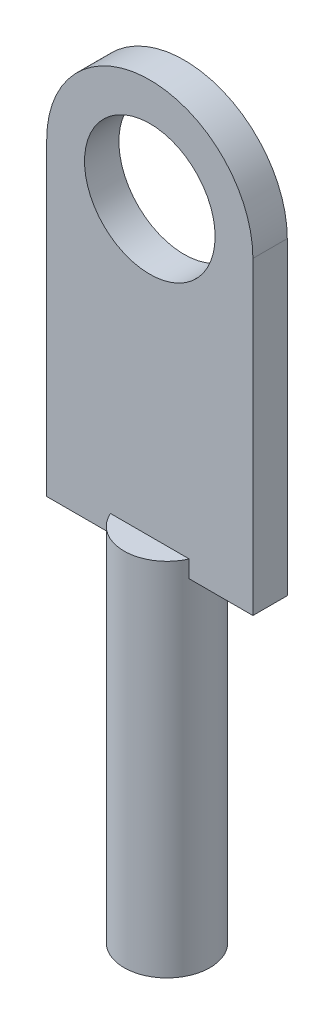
from build123d import *

# Parameters (mm, degrees)
SKETCH1_R           = 1.5875
BOSS_EXTRUDE1_DEPTH = 8.255
SKETCH2_R           = 2.413
BOSS_EXTRUDE2_DEPTH = 0.635
BOSS_EXTRUDE3_START = 5.08
SKETCH3_R           = 1.5875
BOSS_EXTRUDE3_DEPTH = 5.08


with BuildPart() as part:
    # Sketch1 → Boss-Extrude1 (new body)
    with BuildSketch(Plane(origin=(0, 0, 0), x_dir=(1, 0, 0), z_dir=(0, 1, 0))):
        with Locations(Location((0, 0, 0), (0, 0, 270))):
            Circle(SKETCH1_R)
    extrude(amount=BOSS_EXTRUDE1_DEPTH)

    # Sketch2 → Boss-Extrude2 (add, symmetric)
    with BuildSketch(Plane.XY):
        with BuildLine():
            Line((-3.81, 19.05), (-3.81, 7.62))
            Line((-3.81, 7.62), (3.81, 7.62))
            Line((3.81, 7.62), (3.81, 19.05))
            ThreePointArc((3.81, 19.05), (0, 22.86), (-3.81, 19.05))
        make_face()
        with Locations((0, 19.05)):
            Circle(SKETCH2_R, mode=Mode.SUBTRACT)
    extrude(amount=BOSS_EXTRUDE2_DEPTH, both=True)

    # Sketch3 → Boss-Extrude3 (add)
    with BuildSketch(Plane.XZ.offset(BOSS_EXTRUDE3_START)):
        with Locations(Location((0, 0, 0), (0, 0, 270))):
            Circle(SKETCH3_R)
    extrude(amount=-BOSS_EXTRUDE3_DEPTH)


solid = part.part
